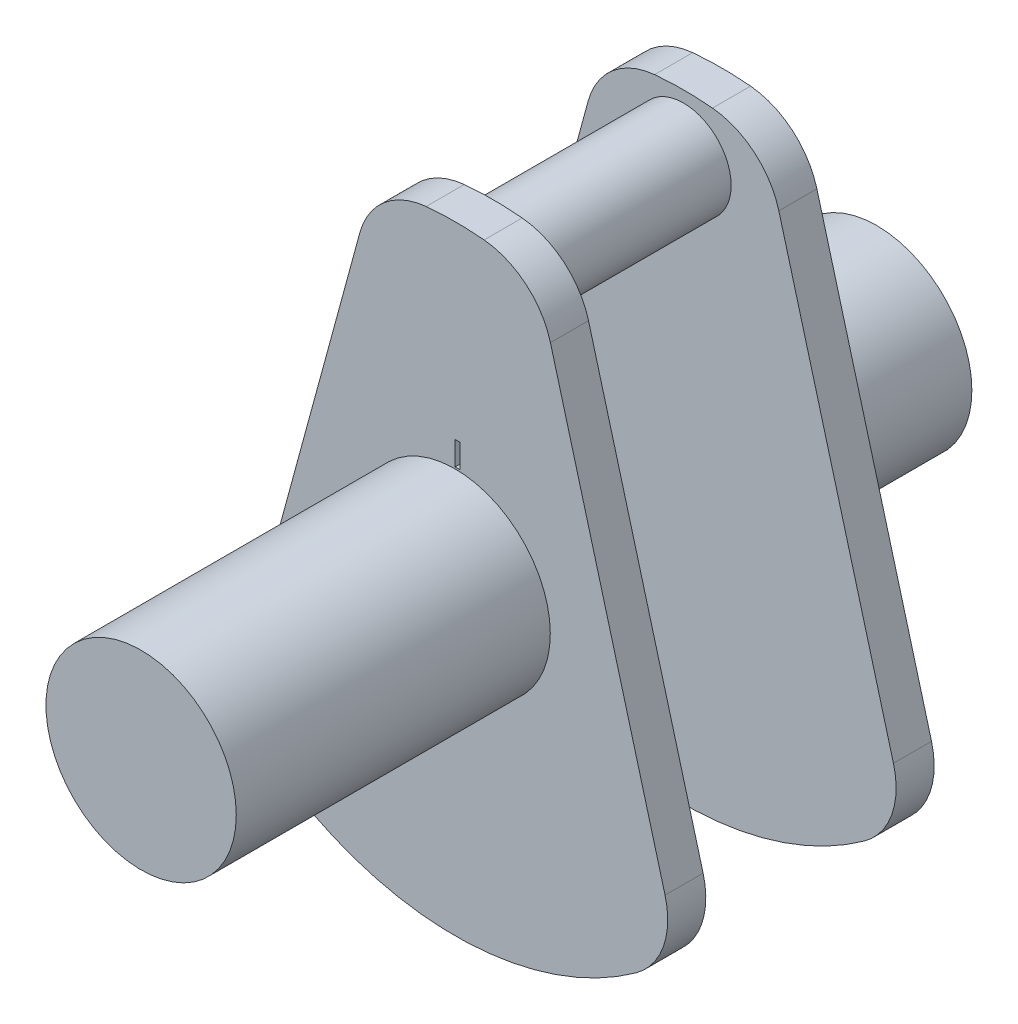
from build123d import *

# Parameters (mm, degrees)
EXTRUDE_1_DEPTH     = 0.8
SKETCH_3_R          = 1
EXTRUDE_2_DEPTH     = 2
SKETCH_4_R          = 2
EXTRUDE_3_DEPTH     = 3.26
SKETCH_5_R          = 2
EXTRUDE_4_DEPTH     = 3.34
SKETCH_6_W          = 0.1
SKETCH_6_H          = 0.5
CUT_EXTRUDE_1_DEPTH = 0.1


with BuildPart() as part:
    # Sketch 2 → Extrude 1 (new body)
    with BuildSketch(Plane.XY):
        with BuildLine():
            Line((-2.002843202, 5.298630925), (-4.411867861, -3.552786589))
            ThreePointArc((-4.411867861, -3.552786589), (-4.376483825, -4.506396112), (-3.804522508, -5.270256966))
            ThreePointArc((-3.804522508, -5.270256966), (0, -6.5), (3.804522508, -5.270256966))
            ThreePointArc((3.804522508, -5.270256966), (4.376483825, -4.506396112), (4.411867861, -3.552786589))
            Line((4.411867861, -3.552786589), (2.002843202, 5.298630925))
            ThreePointArc((2.002843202, 5.298630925), (1.489063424, 6.102778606), (0.608877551, 6.471419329))
            ThreePointArc((0.608877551, 6.471419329), (0, 6.5), (-0.608877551, 6.471419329))
            ThreePointArc((-0.608877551, 6.471419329), (-1.489063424, 6.102778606), (-2.002843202, 5.298630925))
        make_face()
    extrude(amount=EXTRUDE_1_DEPTH)

    # Sketch 3 → Extrude 2 (add)
    with BuildSketch(Plane.XY.offset(0.8)):
        with Locations((0, 5.259)):
            Circle(SKETCH_3_R)
    extrude(amount=EXTRUDE_2_DEPTH)

    # Sketch 4 → Extrude 3 (add)
    with BuildSketch(Plane(origin=(0, 0, 0), x_dir=(-1, 0, 0), z_dir=(0, 0, -1))):
        with Locations(Location((0, 0, 0), (0, 0, 180))):
            Circle(SKETCH_4_R)
    extrude(amount=EXTRUDE_3_DEPTH)

    # Mirror 1: part across plane


with BuildPart() as part_1:
    add(part.part)
    add(part.part.mirror(Plane(origin=(0, 5.259, 2.8), x_dir=(1, 0, 0), z_dir=(0, 0, 1))))

    # Sketch 5 → Extrude 4 (add)
    with BuildSketch(Plane.XY.offset(8.86)):
        Circle(SKETCH_5_R)
    extrude(amount=EXTRUDE_4_DEPTH)

    # Sketch 6 → Cut-Extrude 1 (cut)
    with BuildSketch(Plane.XY.offset(5.6)):
        with Locations((0.05, 2.28505651)):
            Rectangle(SKETCH_6_W, SKETCH_6_H)
    extrude(amount=-CUT_EXTRUDE_1_DEPTH, mode=Mode.SUBTRACT)


solid = part_1.part
